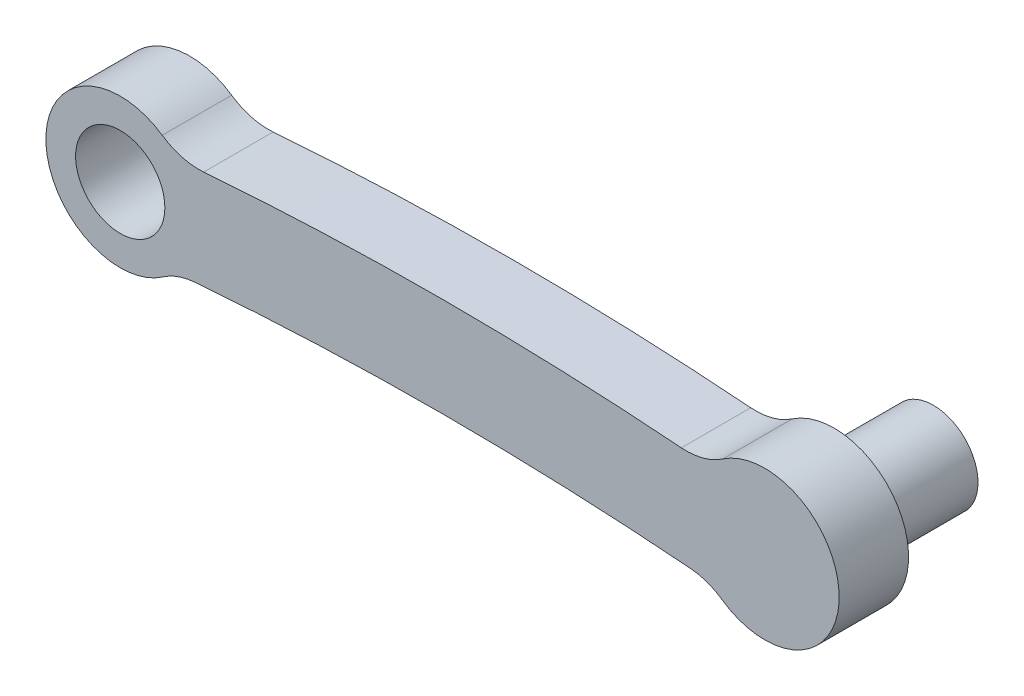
from build123d import *

# Parameters (mm, degrees)
SKETCH1_R           = 45
BOSS_EXTRUDE1_DEPTH = 70
BOSS_EXTRUDE2_START = 100
SKETCH2_R           = 45
BOSS_EXTRUDE2_DEPTH = 100
SKETCH2_2_R         = 45
BOSS_EXTRUDE3_DEPTH = 70
SCALE1_SCALE        = 0.5


with BuildPart() as part:
    # Sketch1 → Boss-Extrude1 (new body)
    with BuildSketch(Plane.XY):
        with BuildLine():
            ThreePointArc((0, -50), (16.813582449, -53.62278956), (32.095096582, -61.515601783))
            ThreePointArc((32.095096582, -61.515601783), (149.99920109, -0.346173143), (32.664786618, 61.90904383))
            ThreePointArc((32.664786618, 61.90904383), (12.707688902, 52.742106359), (-9.160818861, 50.720507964))
            ThreePointArc((-9.160818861, 50.720507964), (-249.999999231, 60), (-490.839179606, 50.720508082))
            ThreePointArc((-490.839179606, 50.720508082), (-512.707688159, 52.74210616), (-532.664786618, 61.90904383))
            ThreePointArc((-532.664786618, 61.90904383), (-649.99920109, -0.346173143), (-532.095096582, -61.515601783))
            ThreePointArc((-532.095096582, -61.515601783), (-516.813582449, -53.62278956), (-500, -50))
            ThreePointArc((-500, -50), (-250, -40), (0, -50))
        make_face()
        with Locations((75, 0)):
            Circle(SKETCH1_R, mode=Mode.SUBTRACT)
        with Locations((-575, 0)):
            Circle(SKETCH1_R, mode=Mode.SUBTRACT)
    extrude(amount=BOSS_EXTRUDE1_DEPTH)



with BuildPart() as body_2:
    # Sketch2 → Boss-Extrude2 (new body)
    with BuildSketch(Plane(origin=(0, 0, 0), x_dir=(-1, 0, 0), z_dir=(0, 0, -1)).offset(BOSS_EXTRUDE2_START)):
        with Locations(Location((-75, 0, 0), (0, 0, 180))):
            Circle(SKETCH2_R)
    extrude(amount=-BOSS_EXTRUDE2_DEPTH)


with BuildPart() as part_1:
    add(part.part)

    add(body_2.part)  # Boss-Extrude3 merges body 2
    # Sketch2_2 → Boss-Extrude3 (add)
    with BuildSketch(Plane(origin=(0, 0, 0), x_dir=(-1, 0, 0), z_dir=(0, 0, -1))):
        with Locations(Location((-75, 0, 0), (0, 0, 180))):
            Circle(SKETCH2_2_R)
    extrude(amount=-BOSS_EXTRUDE3_DEPTH)


with BuildPart() as part_2:
    # Scale1: scaled about (-193.901188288, 3.741342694, 26.369413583)
    add(part_1.part.scale(SCALE1_SCALE).moved(Location((-96.950594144, 1.870671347, 13.184706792))))


solid = part_2.part
